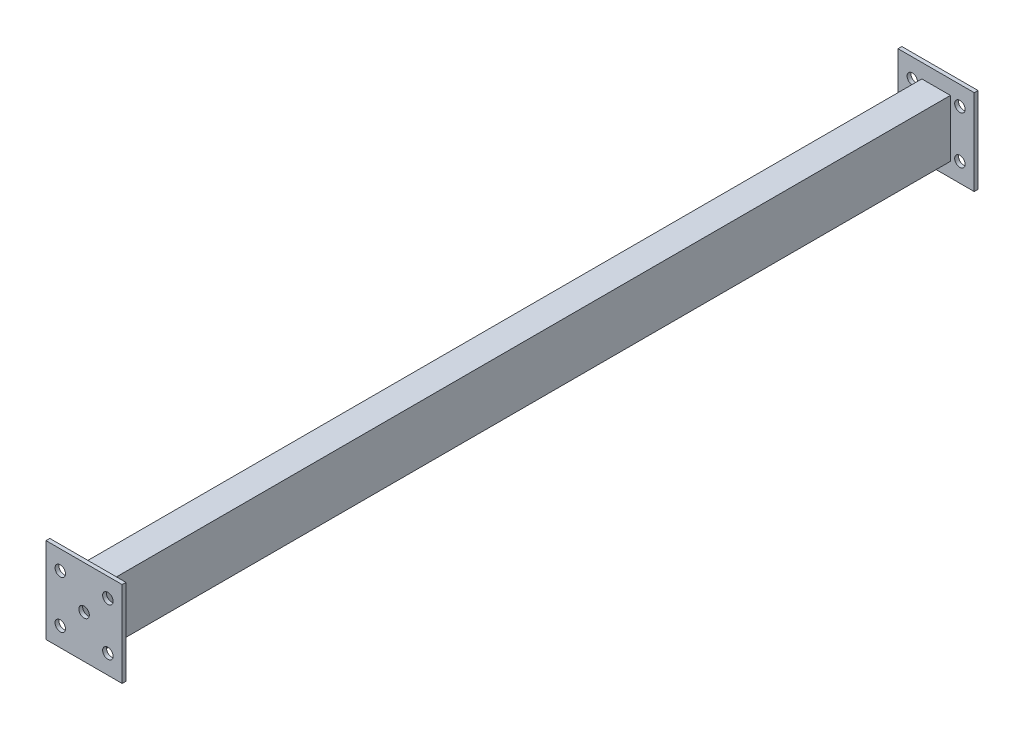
from build123d import *

# Parameters (mm, degrees)
ESQUISSE1_W      = 30
ESQUISSE1_H      = 60
ESQUISSE1_W_2    = 25
ESQUISSE1_H_2    = 55
EXTRUSION1_DEPTH = 445.5
ESQUISSE2_W      = 80
ESQUISSE2_H      = 90
ESQUISSE2_R      = 5.5
EXTRUSION2_DEPTH = 4


with BuildPart() as part:
    # Esquisse1 → Extrusion1 (new body)
    with BuildSketch(Plane.XY):
        Rectangle(ESQUISSE1_W, ESQUISSE1_H)
        Rectangle(ESQUISSE1_W_2, ESQUISSE1_H_2, mode=Mode.SUBTRACT)
    extrusion1 = extrude(amount=EXTRUSION1_DEPTH)

    # Esquisse2 → Extrusion2 (add)
    with BuildSketch(Plane.XY.offset(445.5)):
        Rectangle(ESQUISSE2_W, ESQUISSE2_H)
        with Locations((-25, 25)):
            Circle(ESQUISSE2_R, mode=Mode.SUBTRACT)
        with Locations((25, 25)):
            Circle(ESQUISSE2_R, mode=Mode.SUBTRACT)
        with Locations((-25, -25)):
            Circle(ESQUISSE2_R, mode=Mode.SUBTRACT)
        with Locations((25, -25)):
            Circle(ESQUISSE2_R, mode=Mode.SUBTRACT)
        Circle(ESQUISSE2_R, mode=Mode.SUBTRACT)
    extrusion2 = extrude(amount=EXTRUSION2_DEPTH)

    # Sym_trie1: Extrusion1, Extrusion2 across plane
    add(extrusion1.mirror(Plane(origin=(-15, -30, 0), x_dir=(1, 0, 0), z_dir=(0, 0, 1))))
    add(extrusion2.mirror(Plane(origin=(-15, -30, 0), x_dir=(1, 0, 0), z_dir=(0, 0, 1))))


solid = part.part
